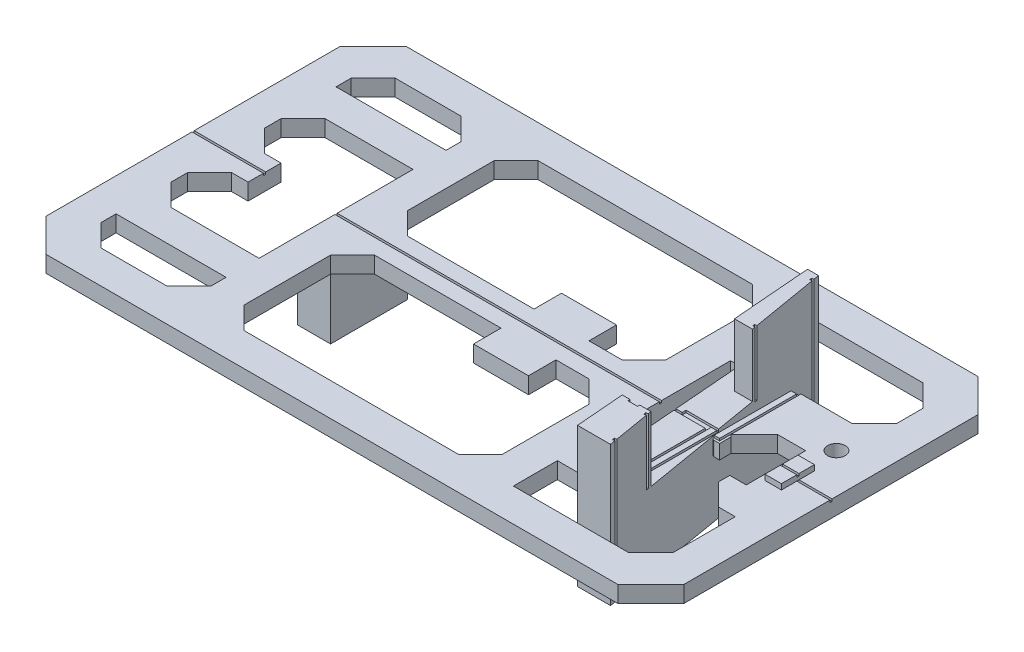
from build123d import *

# Parameters (mm, degrees)
SKETCH1_R           = 1.6
BOSS_EXTRUDE1_DEPTH = 3
SKETCH2_W           = 1
SKETCH2_H           = 14
CUT_EXTRUDE1_DEPTH  = 0.4
SKETCH5_W           = 6
SKETCH5_H           = 14
BOSS_EXTRUDE2_DEPTH = 11
BOSS_EXTRUDE3_DEPTH = 11.4
SKETCH9_W           = 0.4
SKETCH9_H           = 25.4
SKETCH9_H_2         = 12.2
CUT_EXTRUDE5_DEPTH  = 0.4
SKETCH10_W          = 1.8
SKETCH10_H          = 11.8
CUT_EXTRUDE6_DEPTH  = 0.4
SKETCH12_W          = 3
SKETCH12_H          = 6
BOSS_EXTRUDE4_DEPTH = 1
SKETCH13_W          = 3
SKETCH13_H          = 0.398903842
CUT_EXTRUDE7_DEPTH  = 0.4


with BuildPart() as part:
    # Sketch1 → Boss-Extrude1 (new body)
    with BuildSketch(Plane(origin=(0, 0, 0), x_dir=(1, 0, 0), z_dir=(0, 1, 0))):
        Polygon((57, -32.75), (-47, -32.75), (-53, -26.75), (-53, 26.75), (-47, 32.75), (57, 32.75), (63, 26.75), (63, -26.75), align=None)
        with Locations(Location((55.795541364, 8.207333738, 0), (0, 0, 270))):
            Circle(SKETCH1_R, mode=Mode.SUBTRACT)
        with BuildLine():
            Line((43.65, -0.9), (43.65, 1.2))
            Line((43.65, 1.2), (47.85, 5.4))
            Line((47.85, 5.4), (53, 5.4))
            Line((53, 5.4), (53, -5.4))
            Line((53, -5.4), (50, -5.4))
            Line((50, -5.4), (50, -7.4))
            Line((50, -7.4), (54, -11.4))
            Line((54, -11.4), (57, -11.4))
            Line((57, -11.4), (57, -22.75))
            Line((57, -22.75), (53, -26.75))
            Line((53, -26.75), (32, -26.75))
            Line((32, -26.75), (32, -18.75))
            Line((32, -18.75), (39.346239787, -18.75))
            Line((39.346239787, -18.75), (39.668768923, -22.75))
            Line((39.668768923, -22.75), (45.668539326, -22.75))
            Line((45.668539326, -22.75), (38, 22.75))
            Line((38, 22.75), (36, 22.75))
            Line((36, 22.75), (36.322529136, 18.75))
            Line((36.322529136, 18.75), (32, 18.75))
            Line((32, 18.75), (32, 26.75))
            Line((32, 26.75), (53, 26.75))
            Line((53, 26.75), (57, 22.75))
            Line((57, 22.75), (57, 17.9))
            Line((57, 17.9), (53, 13.9))
            Line((53, 13.9), (42.25, 13.9))
            ThreePointArc((42.25, 13.9), (41.967157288, 13.782842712), (41.85, 13.5))
            Line((41.85, 13.5), (41.85, 9.9))
            ThreePointArc((41.85, 9.9), (41.967157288, 9.617157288), (42.25, 9.5))
            Line((42.25, 9.5), (42.25, -0.5))
            ThreePointArc((42.25, -0.5), (42.367157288, -0.782842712), (42.65, -0.9))
            Line((42.65, -0.9), (43.65, -0.9))
        make_face(mode=Mode.SUBTRACT)
        Polygon((-40, -3), (-40, 3), (-43, 3), (-47, 7), (-47, 10), (-43, 14), (-27, 14), (-27, -14), (-43, -14), (-47, -10), (-47, -7), (-43, -3), align=None, mode=Mode.SUBTRACT)
        Polygon((26, -7), (26, -22.75), (22, -26.75), (-17, -26.75), (-21, -22.75), (-21, -7), (-17, -3), (6, -3), (6, -8), (16, -8), (16, -3), (22, -3), align=None, mode=Mode.SUBTRACT)
        Polygon((-31, 26.75), (-43, 26.75), (-47, 22.75), (-47, 20), (-27, 20), (-27, 22.75), align=None, mode=Mode.SUBTRACT)
        Polygon((-21, 22.75), (-21, 7), (-17, 3), (6, 3), (6, 8), (16, 8), (16, 3), (22, 3), (26, 7), (26, 22.75), (22, 26.75), (-17, 26.75), align=None, mode=Mode.SUBTRACT)
        Polygon((32, -12.75), (35.656896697, -12.75), (33.600773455, 12.75), (32, 12.75), align=None, mode=Mode.SUBTRACT)
        Polygon((-27, -20), (-27, -22.75), (-31, -26.75), (-43, -26.75), (-47, -22.75), (-47, -20), align=None, mode=Mode.SUBTRACT)
    extrude(amount=BOSS_EXTRUDE1_DEPTH)

    # Sketch2 → Cut-Extrude1 (cut)
    with BuildSketch(Plane(origin=(0, 3, 0), x_dir=(1, 0, 0), z_dir=(0, 1, 0))):
        Polygon((43.65, 0.184270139), (63, 0.205480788), (63, -0.2), (48.25, -0.2), (48.25, -13.9), (40.35, -13.9), (40.35, -0.2), (-53, -0.2), (-53, 0.2), (35.75, 0.2), (35.75, 0.9), (41.8, 0.9), (41.8, 13.9), (43.65, 13.9), align=None)
        with Locations((41.25, -6.5)):
            Rectangle(SKETCH2_W, SKETCH2_H, mode=Mode.SUBTRACT)
        with Locations((42.75, 6.5)):
            Rectangle(SKETCH2_W, SKETCH2_H, mode=Mode.SUBTRACT)
    extrude(amount=-CUT_EXTRUDE1_DEPTH, mode=Mode.SUBTRACT)

    # Sketch5 → Boss-Extrude2 (add)
    with BuildSketch(Plane(origin=(0, 0, 0), x_dir=(1, 0, 0), z_dir=(0, 1, 0))):
        Polygon((45.668539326, -22.75), (38, 22.75), (36, 22.75), (39.668768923, -22.75), align=None)
        with Locations((-24, 0)):
            Rectangle(SKETCH5_W, SKETCH5_H)
    extrude(amount=-BOSS_EXTRUDE2_DEPTH)

    # Sketch7 → Boss-Extrude3 (add)
    with BuildSketch(Plane(origin=(0, 3, 0), x_dir=(1, 0, 0), z_dir=(0, 1, 0))):
        Polygon((38, 22.75), (40.435393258, 8.3), (37.165136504, 8.3), (36, 22.75), align=None)
        Polygon((45.668539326, -22.75), (39.668768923, -22.75), (38.955173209, -13.9), (44.176966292, -13.9), align=None)
    extrude(amount=BOSS_EXTRUDE3_DEPTH)

    # Sketch9 → Cut-Extrude5 (cut)
    with BuildSketch(Plane(origin=(40.678768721, 0, -6.855972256), x_dir=(-0.16619542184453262, 0, -0.9860928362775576), z_dir=(0.9860928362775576, 0, -0.16619542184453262))):
        with Locations((14.918185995, 1.7)):
            Rectangle(SKETCH9_W, SKETCH9_H)
        with Locations((-28.823514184, 1.7)):
            Rectangle(SKETCH9_W, SKETCH9_H)
        with Locations((-21.848699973, 8.7)):
            Rectangle(SKETCH9_W, SKETCH9_H_2)
        Polygon((2.464990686, 14.798503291), (2.064991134, 14.799101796), (2.046738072, 2.6), (2.44673852, 2.6), align=None)
    extrude(amount=-CUT_EXTRUDE5_DEPTH, mode=Mode.SUBTRACT)

    # Sketch10 → Cut-Extrude6 (cut)
    with BuildSketch(Plane(origin=(0, 0, 13.9), x_dir=(-1, 0, 0), z_dir=(0, 0, -1))):
        with Locations((-41.25, 8.5)):
            Rectangle(SKETCH10_W, SKETCH10_H)
    extrude(amount=-CUT_EXTRUDE6_DEPTH, mode=Mode.SUBTRACT)

    # Sketch12 → Boss-Extrude4 (add)
    with BuildSketch(Plane(origin=(0, 3, 0), x_dir=(1, 0, 0), z_dir=(0, 1, 0))):
        with Locations((55.5, 0)):
            Rectangle(SKETCH12_W, SKETCH12_H)
    extrude(amount=BOSS_EXTRUDE4_DEPTH)

    # Sketch13 → Cut-Extrude7 (cut)
    with BuildSketch(Plane(origin=(0, 4, 0), x_dir=(1, 0, 0), z_dir=(0, 1, 0))):
        with Locations((55.5, -0.000548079)):
            Rectangle(SKETCH13_W, SKETCH13_H)
    extrude(amount=-CUT_EXTRUDE7_DEPTH, mode=Mode.SUBTRACT)


solid = part.part
